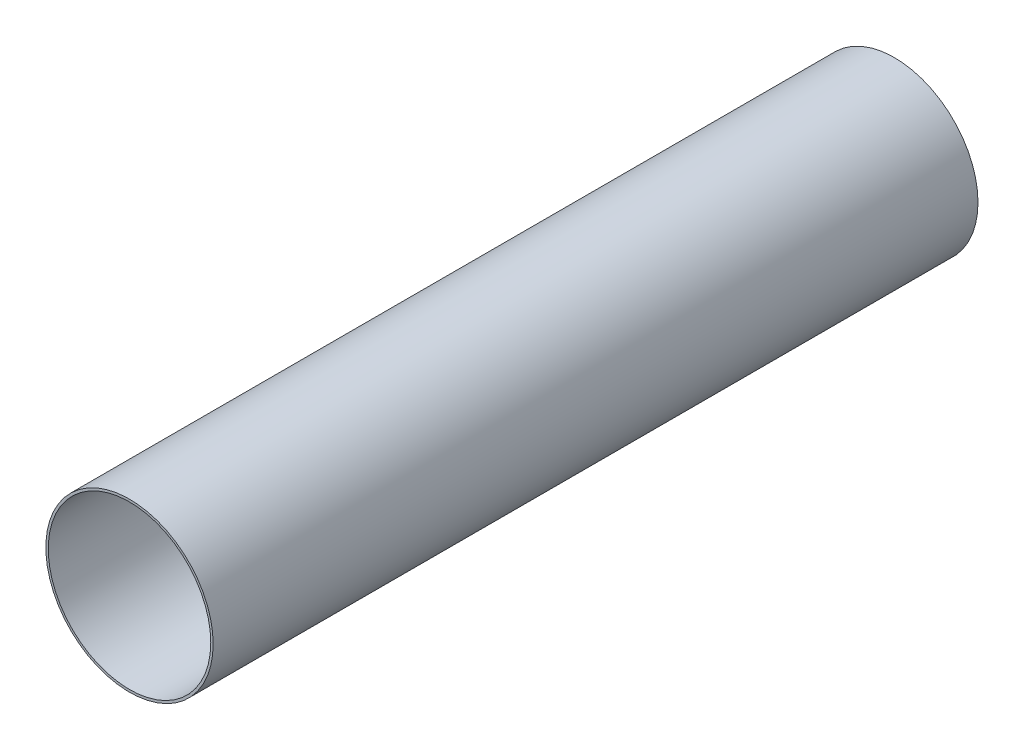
ISO-10303-21;
HEADER;
FILE_DESCRIPTION(('STEP AP214'),'2;1');
FILE_NAME('part.step','',(''),(''),'','','');
FILE_SCHEMA(('AUTOMOTIVE_DESIGN { 1 0 10303 214 1 1 1 1 }'));
ENDSEC;
DATA;
#1=APPLICATION_CONTEXT('core data for automotive mechanical design processes');
#2=APPLICATION_PROTOCOL_DEFINITION('international standard','automotive_design',2000,#1);
#3=PRODUCT_CONTEXT('',#1,'mechanical');
#4=PRODUCT('Part','Part','',(#3));
#5=PRODUCT_RELATED_PRODUCT_CATEGORY('part','',(#4));
#6=PRODUCT_DEFINITION_FORMATION('','',#4);
#7=PRODUCT_DEFINITION_CONTEXT('part definition',#1,'design');
#8=PRODUCT_DEFINITION('design','',#6,#7);
#9=PRODUCT_DEFINITION_SHAPE('','',#8);
#10=(LENGTH_UNIT() NAMED_UNIT(*) SI_UNIT(.MILLI.,.METRE.));
#11=(NAMED_UNIT(*) PLANE_ANGLE_UNIT() SI_UNIT($,.RADIAN.));
#12=(NAMED_UNIT(*) SI_UNIT($,.STERADIAN.) SOLID_ANGLE_UNIT());
#13=UNCERTAINTY_MEASURE_WITH_UNIT(LENGTH_MEASURE(1.E-05),#10,'distance_accuracy_value','');
#14=(GEOMETRIC_REPRESENTATION_CONTEXT(3) GLOBAL_UNCERTAINTY_ASSIGNED_CONTEXT((#13)) GLOBAL_UNIT_ASSIGNED_CONTEXT((#10,
#11,#12)) REPRESENTATION_CONTEXT('',''));
#15=CARTESIAN_POINT('',(0.,0.,0.));
#16=DIRECTION('',(0.,0.,1.));
#17=DIRECTION('',(1.,0.,0.));
#18=AXIS2_PLACEMENT_3D('',#15,#16,#17);
#19=CARTESIAN_POINT('',(0.,0.,254.));
#20=DIRECTION('',(0.,0.,1.));
#21=DIRECTION('',(1.,0.,0.));
#22=AXIS2_PLACEMENT_3D('',#19,#20,#21);
#23=PLANE('',#22);
#24=CARTESIAN_POINT('',(0.,0.,254.));
#25=DIRECTION('',(0.,0.,1.));
#26=DIRECTION('',(1.,0.,0.));
#27=AXIS2_PLACEMENT_3D('',#24,#25,#26);
#28=CIRCLE('',#27,27.78125);
#29=CARTESIAN_POINT('',(27.78125,0.,254.));
#30=VERTEX_POINT('',#29);
#31=EDGE_CURVE('E10',#30,#30,#28,.T.);
#32=ORIENTED_EDGE('',*,*,#31,.T.);
#33=EDGE_LOOP('',(#32));
#34=FACE_BOUND('',#33,.T.);
#35=CARTESIAN_POINT('',(0.,0.,254.));
#36=DIRECTION('',(0.,0.,1.));
#37=DIRECTION('',(1.,0.,0.));
#38=AXIS2_PLACEMENT_3D('',#35,#36,#37);
#39=CIRCLE('',#38,26.9875);
#40=CARTESIAN_POINT('',(26.9875,0.,254.));
#41=VERTEX_POINT('',#40);
#42=EDGE_CURVE('E40',#41,#41,#39,.T.);
#43=ORIENTED_EDGE('',*,*,#42,.F.);
#44=EDGE_LOOP('',(#43));
#45=FACE_BOUND('',#44,.T.);
#46=ADVANCED_FACE('F29',(#34,#45),#23,.T.);
#47=CARTESIAN_POINT('',(0.,0.,0.));
#48=DIRECTION('',(0.,0.,1.));
#49=DIRECTION('',(1.,0.,0.));
#50=AXIS2_PLACEMENT_3D('',#47,#48,#49);
#51=PLANE('',#50);
#52=CARTESIAN_POINT('',(0.,0.,0.));
#53=DIRECTION('',(0.,0.,1.));
#54=DIRECTION('',(1.,0.,0.));
#55=AXIS2_PLACEMENT_3D('',#52,#53,#54);
#56=CIRCLE('',#55,27.78125);
#57=CARTESIAN_POINT('',(27.78125,0.,0.));
#58=VERTEX_POINT('',#57);
#59=EDGE_CURVE('E36',#58,#58,#56,.T.);
#60=ORIENTED_EDGE('',*,*,#59,.F.);
#61=EDGE_LOOP('',(#60));
#62=FACE_BOUND('',#61,.T.);
#63=CARTESIAN_POINT('',(0.,0.,0.));
#64=DIRECTION('',(0.,0.,1.));
#65=DIRECTION('',(1.,0.,0.));
#66=AXIS2_PLACEMENT_3D('',#63,#64,#65);
#67=CIRCLE('',#66,26.9875);
#68=CARTESIAN_POINT('',(26.9875,0.,0.));
#69=VERTEX_POINT('',#68);
#70=EDGE_CURVE('E44',#69,#69,#67,.T.);
#71=ORIENTED_EDGE('',*,*,#70,.T.);
#72=EDGE_LOOP('',(#71));
#73=FACE_BOUND('',#72,.T.);
#74=ADVANCED_FACE('F50',(#62,#73),#51,.F.);
#75=CARTESIAN_POINT('',(0.,0.,254.));
#76=DIRECTION('',(0.,0.,-1.));
#77=DIRECTION('',(-1.,0.,0.));
#78=AXIS2_PLACEMENT_3D('',#75,#76,#77);
#79=CYLINDRICAL_SURFACE('',#78,27.78125);
#80=ORIENTED_EDGE('',*,*,#31,.F.);
#81=EDGE_LOOP('',(#80));
#82=FACE_BOUND('',#81,.T.);
#83=ORIENTED_EDGE('',*,*,#59,.T.);
#84=EDGE_LOOP('',(#83));
#85=FACE_BOUND('',#84,.T.);
#86=ADVANCED_FACE('F31',(#82,#85),#79,.T.);
#87=CARTESIAN_POINT('',(0.,0.,254.));
#88=DIRECTION('',(0.,0.,-1.));
#89=DIRECTION('',(-1.,0.,0.));
#90=AXIS2_PLACEMENT_3D('',#87,#88,#89);
#91=CYLINDRICAL_SURFACE('',#90,26.9875);
#92=ORIENTED_EDGE('',*,*,#42,.T.);
#93=EDGE_LOOP('',(#92));
#94=FACE_BOUND('',#93,.T.);
#95=ORIENTED_EDGE('',*,*,#70,.F.);
#96=EDGE_LOOP('',(#95));
#97=FACE_BOUND('',#96,.T.);
#98=ADVANCED_FACE('F52',(#94,#97),#91,.F.);
#99=CLOSED_SHELL('',(#46,#74,#86,#98));
#100=MANIFOLD_SOLID_BREP('B2',#99);
#101=ADVANCED_BREP_SHAPE_REPRESENTATION('',(#18,#100),#14);
#102=SHAPE_DEFINITION_REPRESENTATION(#9,#101);
ENDSEC;
END-ISO-10303-21;
